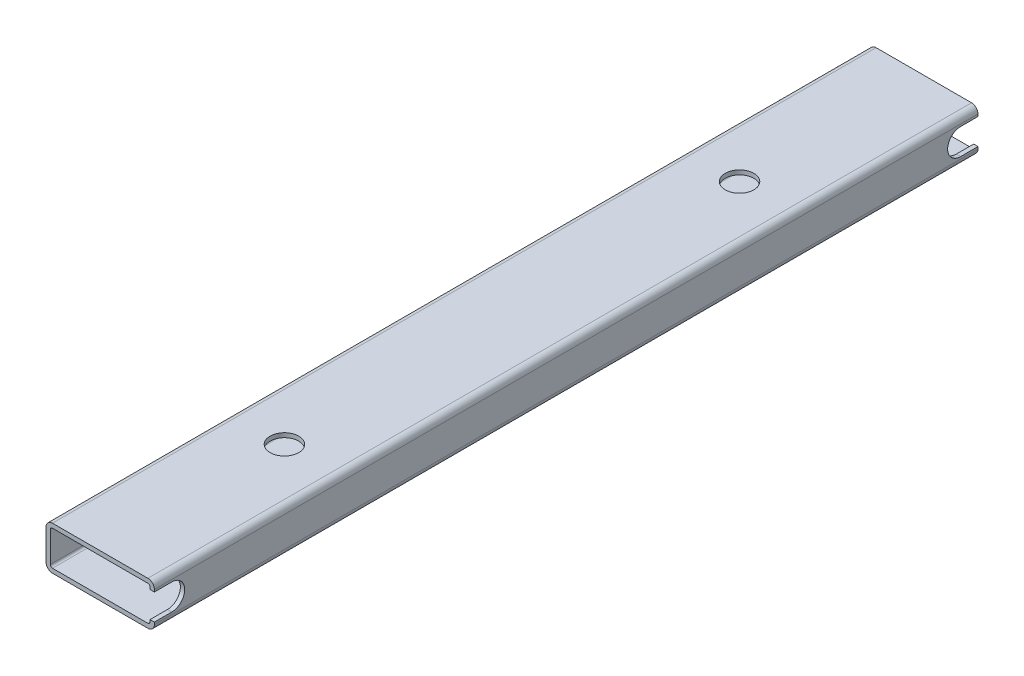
from build123d import *

# Parameters (mm, degrees)
BOSS_EXTRU_1_DEPTH      = 95
D_GAGEMENT_M61_D        = 6.6
ENL_V_MAT_EXTRU_2_REACH = 100.362


with BuildPart() as part:
    # Esquisse1 → Boss.-Extru.1 (new, symmetric)
    with BuildSketch(Plane.XY):
        with BuildLine():
            Line((-11, 5), (11, 5))
            ThreePointArc((11, 5), (12.060660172, 4.560660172), (12.5, 3.5))
            Line((12.5, 3.5), (12.5, -3.5))
            ThreePointArc((12.5, -3.5), (12.060660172, -4.560660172), (11, -5))
            Line((11, -5), (-11, -5))
            ThreePointArc((-11, -5), (-12.060660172, -4.560660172), (-12.5, -3.5))
            Line((-12.5, -3.5), (-12.5, 3.5))
            ThreePointArc((-12.5, 3.5), (-12.060660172, 4.560660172), (-11, 5))
        make_face()
        with BuildLine():
            Line((-11, 4), (11, 4))
            ThreePointArc((11, 4), (11.353553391, 3.853553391), (11.5, 3.5))
            Line((11.5, 3.5), (11.5, -3.5))
            ThreePointArc((11.5, -3.5), (11.353553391, -3.853553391), (11, -4))
            Line((11, -4), (-11, -4))
            ThreePointArc((-11, -4), (-11.353553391, -3.853553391), (-11.5, -3.5))
            Line((-11.5, -3.5), (-11.5, 3.5))
            ThreePointArc((-11.5, 3.5), (-11.353553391, 3.853553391), (-11, 4))
        make_face(mode=Mode.SUBTRACT)
    extrude(amount=BOSS_EXTRU_1_DEPTH, both=True)

    # D_gagement M61 (through all)
    with Locations(Plane(origin=(0, 5, 0), x_dir=(1, 0, 0), z_dir=(0, 1, 0))):
        with Locations((0, -52.5), (0, 52.5)):
            Hole(D_GAGEMENT_M61_D / 2)

    # Esquisse4 → Enl_v. mat.-Extru.2 (cut, up to next)
    with BuildSketch(Plane(origin=(12.5, 0, 0), x_dir=(0, 0, -1), z_dir=(1, 0, 0)), mode=Mode.PRIVATE) as enl_v_mat_extru_2_sk1:
        with BuildLine():
            Line((-95, 3), (-91, 3))
            ThreePointArc((-91, 3), (-88, 0), (-91, -3))
            Line((-91, -3), (-95, -3))
            Line((-95, -3), (-95, 3))
        make_face()
    enl_v_mat_extru_2_tool1 = extrude(enl_v_mat_extru_2_sk1.sketch, amount=-ENL_V_MAT_EXTRU_2_REACH, mode=Mode.PRIVATE) & part.part
    enl_v_mat_extru_2 = enl_v_mat_extru_2_tool1.solids().sort_by_distance((12.5, 0, 91.786634))[0]
    add(enl_v_mat_extru_2, mode=Mode.SUBTRACT)

    # Sym_trie1: Enl_v. mat.-Extru.2 across plane
    add(enl_v_mat_extru_2.mirror(Plane.XY), mode=Mode.SUBTRACT)


solid = part.part
